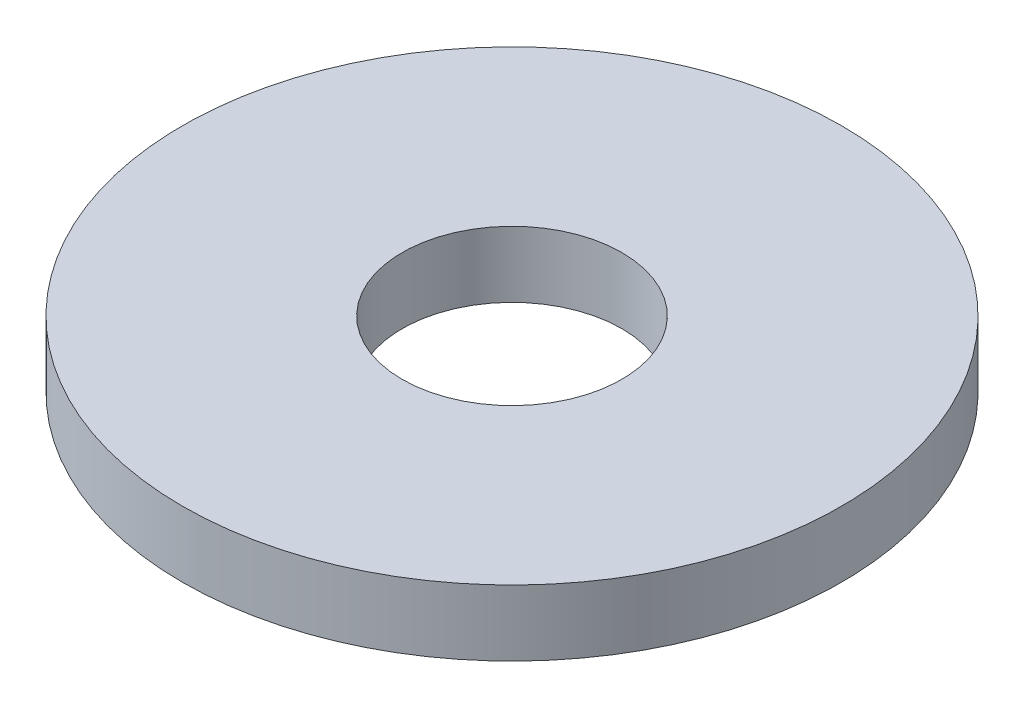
from build123d import *

# Parameters (mm, degrees)
SKETCH1_R      = 15
SKETCH1_R_2    = 5
EXTRUDE1_DEPTH = 3


with BuildPart() as part:
    # Sketch1 → Extrude1 (new body)
    with BuildSketch(Plane(origin=(0, 0, 0), x_dir=(1, 0, 0), z_dir=(0, 1, 0))):
        with Locations(Location((0, 0, 0), (0, 0, 270))):
            Circle(SKETCH1_R)
        with Locations(Location((0, 0, 0), (0, 0, 270))):
            Circle(SKETCH1_R_2, mode=Mode.SUBTRACT)
    extrude(amount=EXTRUDE1_DEPTH)


solid = part.part
